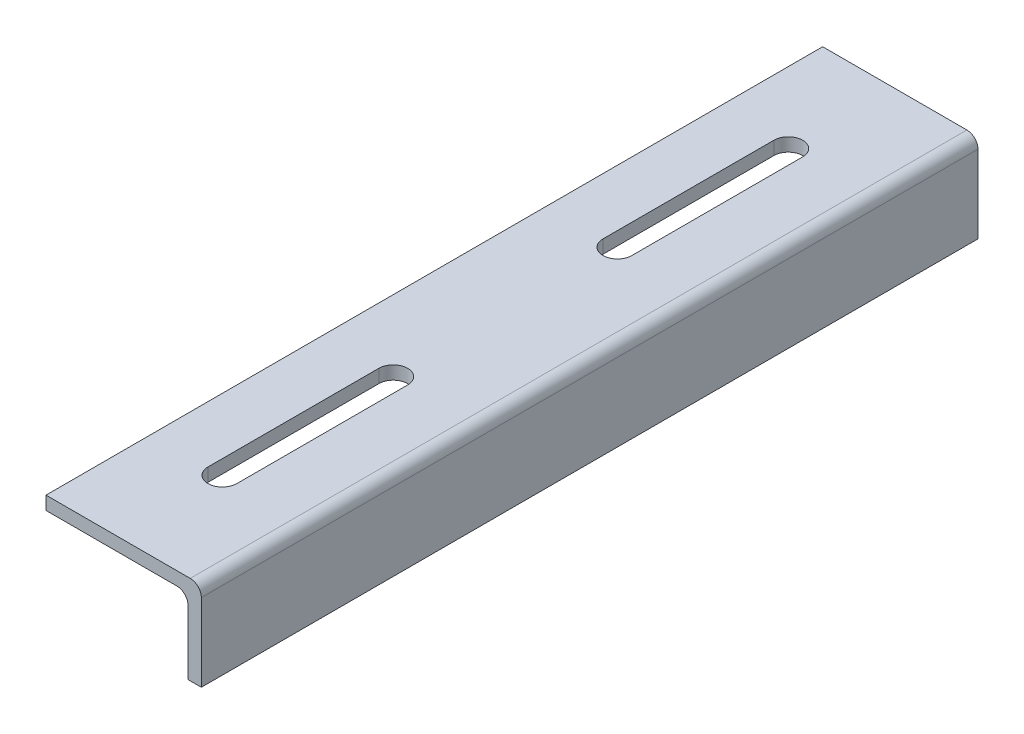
from build123d import *

# Parameters (mm, degrees)
EXTRUDE_1_DEPTH        = 350
CUT_EXTRUDE_1_DEPTH    = 350
PATTERN_LINEAR_1_COUNT = 2
PATTERN_LINEAR_1_PITCH = 178
FILLET_1_R             = 5


with BuildPart() as part:
    # Sketch 1 → Extrude 1 (new body)
    with BuildSketch(Plane.XY):
        Polygon((-70, 0), (0, 0), (0, -40), (-6, -40), (-6, -6), (-70, -6), align=None)
    extrude(amount=EXTRUDE_1_DEPTH)

    # Sketch 2 → Cut-Extrude 1 (cut)
    with BuildSketch(Plane(origin=(0, 0, 0), x_dir=(-1, 0, 0), z_dir=(0, 1, 0))):
        with BuildLine():
            Line((31.5, 225.5), (31.5, 302.5))
            ThreePointArc((31.5, 302.5), (38, 309), (44.5, 302.5))
            Line((44.5, 302.5), (44.5, 225.5))
            ThreePointArc((44.5, 225.5), (38, 219), (31.5, 225.5))
        make_face()
    cut_extrude_1 = extrude(amount=-CUT_EXTRUDE_1_DEPTH, mode=Mode.SUBTRACT)

    # Pattern Linear 1: Cut-Extrude 1 ×2
    with Locations(*[(0, 0, -i * PATTERN_LINEAR_1_PITCH) for i in range(1, PATTERN_LINEAR_1_COUNT)]):
        add(cut_extrude_1, mode=Mode.SUBTRACT)

    # Fillet 1
    fillet_1_edges = [part.edges().sort_by_distance(p)[0] for p in [
        (-6, -6, 175),
        (0, 0, 175),
    ]]
    fillet(fillet_1_edges, radius=FILLET_1_R)


solid = part.part
